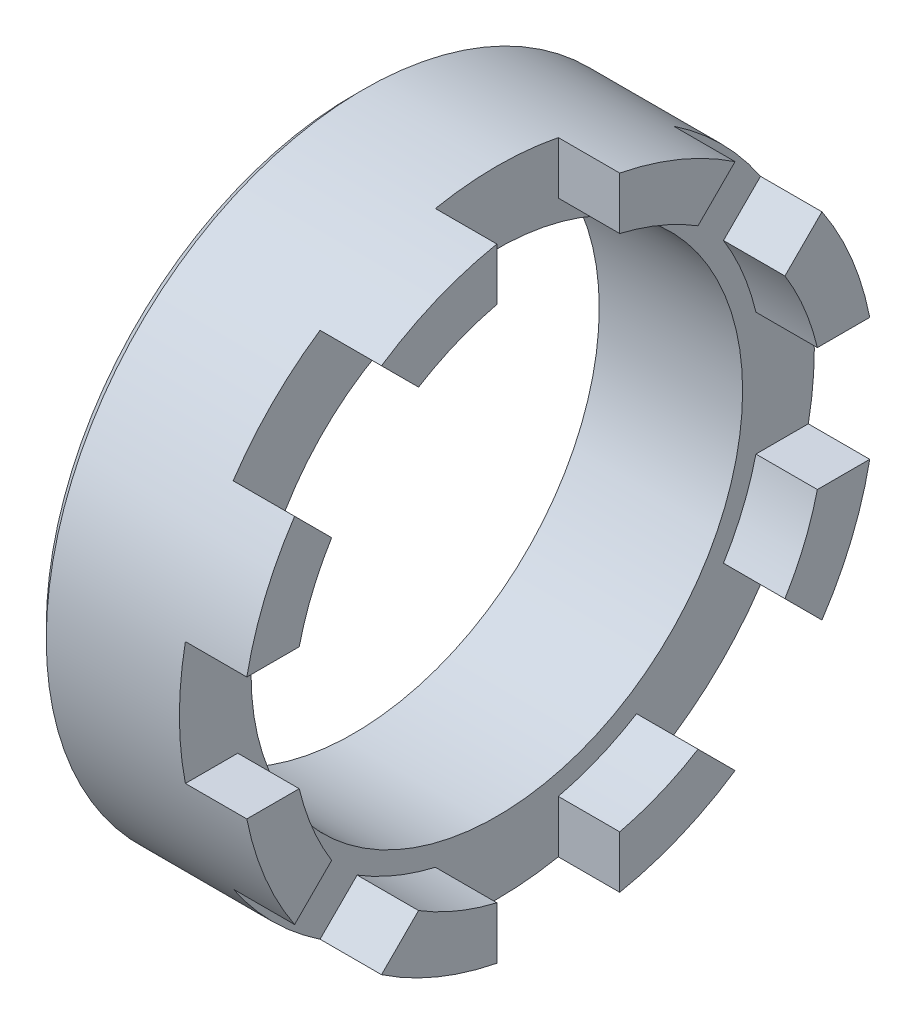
from build123d import *

# Parameters (mm, degrees)
ESQUISSE2_W                  = 4
ESQUISSE2_H                  = 6
ENL_V_MAT_EXTRU_1_DEPTH      = 37.503424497
R_P_TITION_CIRCULAIRE1_COUNT = 4
R_P_TITION_CIRCULAIRE1_ANGLE = 135


with BuildPart() as part:
    # Esquisse1 → Base-R_volution (revolve)
    with BuildSketch(Plane.XY, mode=Mode.PRIVATE) as base_r_volution_sk:
        Polygon((0, 12), (0, 15), (0.5, 15.5), (10, 15.5), (10, 13), (7, 13), (7, 12), align=None)
    revolve(base_r_volution_sk.sketch.rotate(Axis((-2, 0, 0), (1, 0, 0)), 90), axis=Axis((-2, 0, 0), (1, 0, 0)))

    # Esquisse2 → Enl_v. mat.-Extru.1 (cut, through all)
    with BuildSketch(Plane(origin=(0, 16, 0), x_dir=(-1, 0, 0), z_dir=(0, 1, 0))):
        with Locations((-9, 0)):
            Rectangle(ESQUISSE2_W, ESQUISSE2_H)
    enl_v_mat_extru_1 = extrude(amount=-ENL_V_MAT_EXTRU_1_DEPTH, mode=Mode.SUBTRACT)

    # R_p_tition circulaire1: Enl_v. mat.-Extru.1 ×4 about axis
    r_p_tition_circulaire1_axis = Axis((-2, 0, 0), (1, 0, 0))
    for i in range(1, R_P_TITION_CIRCULAIRE1_COUNT):
        add(enl_v_mat_extru_1.rotate(r_p_tition_circulaire1_axis, i * R_P_TITION_CIRCULAIRE1_ANGLE / (R_P_TITION_CIRCULAIRE1_COUNT - 1)), mode=Mode.SUBTRACT)


solid = part.part
